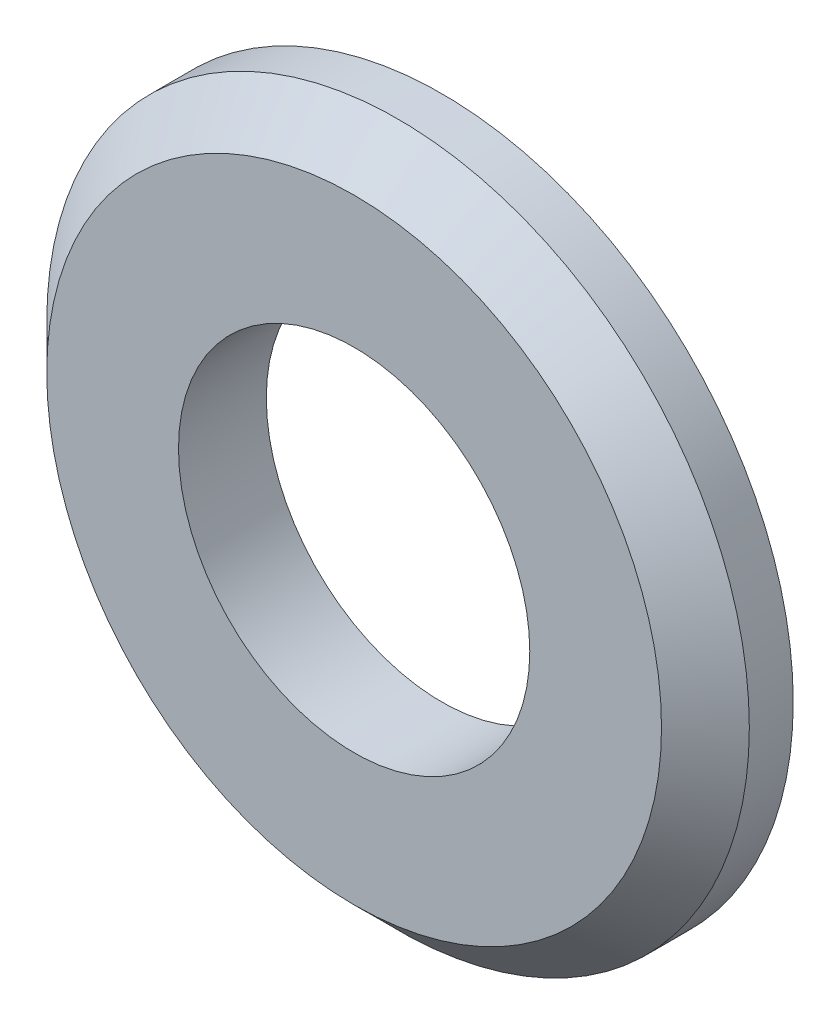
ISO-10303-21;
HEADER;
FILE_DESCRIPTION(('STEP AP214'),'2;1');
FILE_NAME('part.step','',(''),(''),'','','');
FILE_SCHEMA(('AUTOMOTIVE_DESIGN { 1 0 10303 214 1 1 1 1 }'));
ENDSEC;
DATA;
#1=APPLICATION_CONTEXT('core data for automotive mechanical design processes');
#2=APPLICATION_PROTOCOL_DEFINITION('international standard','automotive_design',2000,#1);
#3=PRODUCT_CONTEXT('',#1,'mechanical');
#4=PRODUCT('Part','Part','',(#3));
#5=PRODUCT_RELATED_PRODUCT_CATEGORY('part','',(#4));
#6=PRODUCT_DEFINITION_FORMATION('','',#4);
#7=PRODUCT_DEFINITION_CONTEXT('part definition',#1,'design');
#8=PRODUCT_DEFINITION('design','',#6,#7);
#9=PRODUCT_DEFINITION_SHAPE('','',#8);
#10=(LENGTH_UNIT() NAMED_UNIT(*) SI_UNIT(.MILLI.,.METRE.));
#11=(NAMED_UNIT(*) PLANE_ANGLE_UNIT() SI_UNIT($,.RADIAN.));
#12=(NAMED_UNIT(*) SI_UNIT($,.STERADIAN.) SOLID_ANGLE_UNIT());
#13=UNCERTAINTY_MEASURE_WITH_UNIT(LENGTH_MEASURE(1.E-05),#10,'distance_accuracy_value','');
#14=(GEOMETRIC_REPRESENTATION_CONTEXT(3) GLOBAL_UNCERTAINTY_ASSIGNED_CONTEXT((#13)) GLOBAL_UNIT_ASSIGNED_CONTEXT((#10,
#11,#12)) REPRESENTATION_CONTEXT('',''));
#15=CARTESIAN_POINT('',(0.,0.,0.));
#16=DIRECTION('',(0.,0.,1.));
#17=DIRECTION('',(1.,0.,0.));
#18=AXIS2_PLACEMENT_3D('',#15,#16,#17);
#19=CARTESIAN_POINT('',(0.,0.,1.));
#20=DIRECTION('',(0.,0.,1.));
#21=DIRECTION('',(1.,0.,0.));
#22=AXIS2_PLACEMENT_3D('',#19,#20,#21);
#23=PLANE('',#22);
#24=CARTESIAN_POINT('',(0.,0.,1.));
#25=DIRECTION('',(0.,0.,1.));
#26=DIRECTION('',(1.,0.,0.));
#27=AXIS2_PLACEMENT_3D('',#24,#25,#26);
#28=CIRCLE('',#27,3.5);
#29=CARTESIAN_POINT('',(3.5,0.,1.));
#30=VERTEX_POINT('',#29);
#31=EDGE_CURVE('E38',#30,#30,#28,.T.);
#32=ORIENTED_EDGE('',*,*,#31,.T.);
#33=EDGE_LOOP('',(#32));
#34=FACE_BOUND('',#33,.T.);
#35=CARTESIAN_POINT('',(0.,0.,1.));
#36=DIRECTION('',(0.,0.,1.));
#37=DIRECTION('',(1.,0.,0.));
#38=AXIS2_PLACEMENT_3D('',#35,#36,#37);
#39=CIRCLE('',#38,2.);
#40=CARTESIAN_POINT('',(2.,0.,1.));
#41=VERTEX_POINT('',#40);
#42=EDGE_CURVE('E46',#41,#41,#39,.T.);
#43=ORIENTED_EDGE('',*,*,#42,.F.);
#44=EDGE_LOOP('',(#43));
#45=FACE_BOUND('',#44,.T.);
#46=ADVANCED_FACE('F31',(#34,#45),#23,.T.);
#47=CARTESIAN_POINT('',(0.,0.,0.));
#48=DIRECTION('',(0.,0.,1.));
#49=DIRECTION('',(1.,0.,0.));
#50=AXIS2_PLACEMENT_3D('',#47,#48,#49);
#51=PLANE('',#50);
#52=CARTESIAN_POINT('',(0.,0.,0.));
#53=DIRECTION('',(0.,0.,1.));
#54=DIRECTION('',(1.,0.,0.));
#55=AXIS2_PLACEMENT_3D('',#52,#53,#54);
#56=CIRCLE('',#55,4.);
#57=CARTESIAN_POINT('',(4.,0.,0.));
#58=VERTEX_POINT('',#57);
#59=EDGE_CURVE('E42',#58,#58,#56,.T.);
#60=ORIENTED_EDGE('',*,*,#59,.F.);
#61=EDGE_LOOP('',(#60));
#62=FACE_BOUND('',#61,.T.);
#63=CARTESIAN_POINT('',(0.,0.,0.));
#64=DIRECTION('',(0.,0.,1.));
#65=DIRECTION('',(1.,0.,0.));
#66=AXIS2_PLACEMENT_3D('',#63,#64,#65);
#67=CIRCLE('',#66,2.);
#68=CARTESIAN_POINT('',(2.,0.,0.));
#69=VERTEX_POINT('',#68);
#70=EDGE_CURVE('E49',#69,#69,#67,.T.);
#71=ORIENTED_EDGE('',*,*,#70,.T.);
#72=EDGE_LOOP('',(#71));
#73=FACE_BOUND('',#72,.T.);
#74=ADVANCED_FACE('F59',(#62,#73),#51,.F.);
#75=CARTESIAN_POINT('',(0.,0.,1.));
#76=DIRECTION('',(0.,0.,-1.));
#77=DIRECTION('',(-1.,0.,0.));
#78=AXIS2_PLACEMENT_3D('',#75,#76,#77);
#79=CYLINDRICAL_SURFACE('',#78,4.);
#80=CARTESIAN_POINT('',(0.,0.,0.5));
#81=DIRECTION('',(0.,0.,1.));
#82=DIRECTION('',(1.,0.,0.));
#83=AXIS2_PLACEMENT_3D('',#80,#81,#82);
#84=CIRCLE('',#83,4.);
#85=CARTESIAN_POINT('',(4.,0.,0.5));
#86=VERTEX_POINT('',#85);
#87=EDGE_CURVE('E10',#86,#86,#84,.F.);
#88=ORIENTED_EDGE('',*,*,#87,.T.);
#89=EDGE_LOOP('',(#88));
#90=FACE_BOUND('',#89,.T.);
#91=ORIENTED_EDGE('',*,*,#59,.T.);
#92=EDGE_LOOP('',(#91));
#93=FACE_BOUND('',#92,.T.);
#94=ADVANCED_FACE('F64',(#90,#93),#79,.T.);
#95=CARTESIAN_POINT('',(0.,0.,1.));
#96=DIRECTION('',(0.,0.,-1.));
#97=DIRECTION('',(-1.,0.,0.));
#98=AXIS2_PLACEMENT_3D('',#95,#96,#97);
#99=CYLINDRICAL_SURFACE('',#98,2.);
#100=ORIENTED_EDGE('',*,*,#42,.T.);
#101=EDGE_LOOP('',(#100));
#102=FACE_BOUND('',#101,.T.);
#103=ORIENTED_EDGE('',*,*,#70,.F.);
#104=EDGE_LOOP('',(#103));
#105=FACE_BOUND('',#104,.T.);
#106=ADVANCED_FACE('F55',(#102,#105),#99,.F.);
#107=CARTESIAN_POINT('',(0.,0.,1.));
#108=DIRECTION('',(0.,0.,-1.));
#109=DIRECTION('',(-1.,0.,0.));
#110=AXIS2_PLACEMENT_3D('',#107,#108,#109);
#111=CONICAL_SURFACE('',#110,3.5,0.785398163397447);
#112=ORIENTED_EDGE('',*,*,#87,.F.);
#113=EDGE_LOOP('',(#112));
#114=FACE_BOUND('',#113,.T.);
#115=ORIENTED_EDGE('',*,*,#31,.F.);
#116=EDGE_LOOP('',(#115));
#117=FACE_BOUND('',#116,.T.);
#118=ADVANCED_FACE('F33',(#114,#117),#111,.T.);
#119=CLOSED_SHELL('',(#46,#74,#94,#106,#118));
#120=MANIFOLD_SOLID_BREP('B2',#119);
#121=ADVANCED_BREP_SHAPE_REPRESENTATION('',(#18,#120),#14);
#122=SHAPE_DEFINITION_REPRESENTATION(#9,#121);
ENDSEC;
END-ISO-10303-21;
